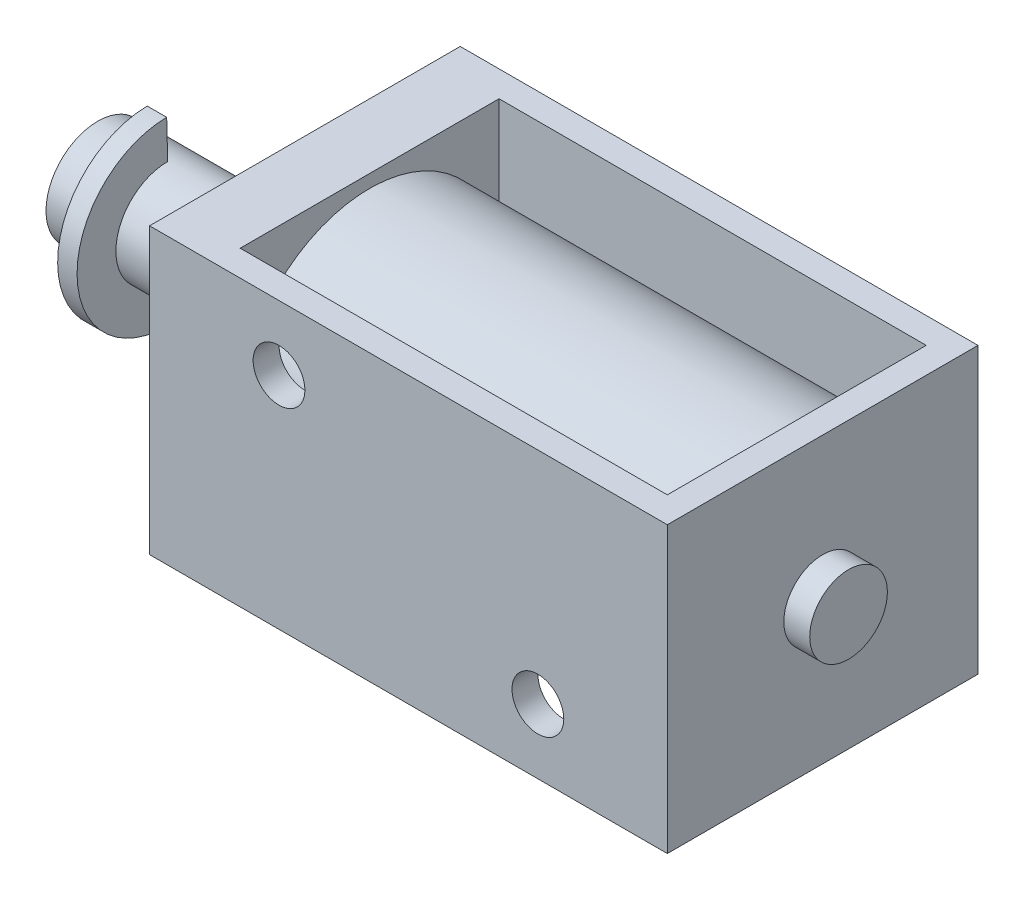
from build123d import *

# Parameters (mm, degrees)
SKETCH1_W                = 20
SKETCH1_H                = 12
BOSS_EXTRUDE1_DEPTH      = 11
SKETCH3_W                = 16.5
SKETCH3_H                = 10
CUT_EXTRUDE1_DEPTH       = 26.787593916
BOSS_EXTRUDE3_REACH      = 25.901
SKETCH4_R                = 5
SKETCH5_R                = 2
BOSS_EXTRUDE4_DEPTH      = 8
SKETCH6_R                = 1.5
BOSS_EXTRUDE5_DEPTH      = 1
BOSS_EXTRUDE6_DEPTH      = 0.75
SCHIZZO1_R               = 1
TAGLIO_ESTRUSIONE1_DEPTH = 2


with BuildPart() as part:
    # Sketch1 → Boss-Extrude1 (new body)
    with BuildSketch(Plane(origin=(0, 0, 0), x_dir=(1, 0, 0), z_dir=(0, 1, 0))):
        with Locations((10, 6)):
            Rectangle(SKETCH1_W, SKETCH1_H)
    extrude(amount=BOSS_EXTRUDE1_DEPTH)

    # Sketch3 → Cut-Extrude1 (cut, through all)
    with BuildSketch(Plane(origin=(0, 11, 0), x_dir=(1, 0, 0), z_dir=(0, 1, 0))):
        with Locations((10.75, 6)):
            Rectangle(SKETCH3_W, SKETCH3_H)
    extrude(amount=-CUT_EXTRUDE1_DEPTH, mode=Mode.SUBTRACT)


with BuildPart() as body_2:

    # Sketch4 → Boss-Extrude3 (new, up to next)
    with BuildSketch(Plane(origin=(2.5, 0, 0), x_dir=(0, 0, -1), z_dir=(1, 0, 0)), mode=Mode.PRIVATE) as boss_extrude3_sk1:
        with Locations((6, 5.5)):
            Circle(SKETCH4_R)
    boss_extrude3_tool1 = extrude(boss_extrude3_sk1.sketch, amount=BOSS_EXTRUDE3_REACH, mode=Mode.PRIVATE) - part.part
    add(boss_extrude3_tool1.solids().sort_by_distance((2.5, 5.5, -6))[0])


with BuildPart() as part_1:
    add(part.part)

    # Sketch5 → Boss-Extrude4 (add)
    with BuildSketch(Plane.ZY):
        with Locations(Location((-6, 5.5, 0), (0, 0, 180))):
            Circle(SKETCH5_R)
    extrude(amount=BOSS_EXTRUDE4_DEPTH)

    # Sketch6 → Boss-Extrude5 (add)
    with BuildSketch(Plane(origin=(20, 0, 0), x_dir=(0, 0, -1), z_dir=(1, 0, 0))):
        with Locations(Location((6, 5.5, 0), (0, 0, 180))):
            Circle(SKETCH6_R)
    extrude(amount=BOSS_EXTRUDE5_DEPTH)

    # Sketch7 → Boss-Extrude6 (add)
    with BuildSketch(Plane.ZY.offset(5.3)):
        with BuildLine():
            Line((-6, 7.5), (-5.961540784, 8.999788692))
            ThreePointArc((-5.961540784, 8.999788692), (-2.500052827, 5.480770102), (-6, 2))
            Line((-6, 2), (-6, 3.5))
            ThreePointArc((-6, 3.5), (-4, 5.5), (-6, 7.5))
        make_face()
    extrude(amount=BOSS_EXTRUDE6_DEPTH)


with BuildPart() as taglio_estrusione1_tool:
    # Schizzo1 → Taglio-Estrusione1 (new body)
    with BuildSketch(Plane.XY):
        with Locations((15, 2.5)):
            Circle(SCHIZZO1_R)
        with Locations((5, 8.5)):
            Circle(SCHIZZO1_R)
    extrude(amount=-TAGLIO_ESTRUSIONE1_DEPTH)


with BuildPart() as part_2:
    add(part_1.part)

    # Taglio-Estrusione1: cut by taglio_estrusione1_tool
    add(taglio_estrusione1_tool.part, mode=Mode.SUBTRACT)


with BuildPart() as body_2_1:
    add(body_2.part)

    # Taglio-Estrusione1: cut by taglio_estrusione1_tool
    add(taglio_estrusione1_tool.part, mode=Mode.SUBTRACT)


solid = Compound([part_2.part, body_2_1.part])
